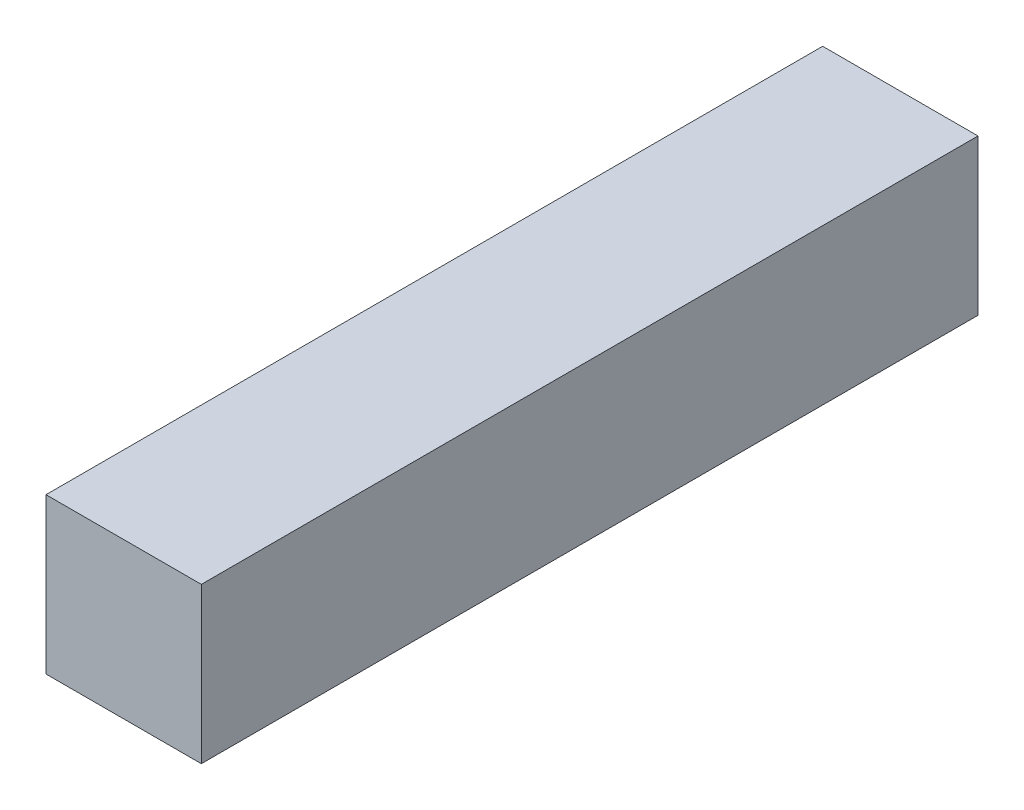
from build123d import *

# Parameters (mm, degrees)
SKETCH1_W      = 20
SKETCH1_H      = 20
EXTRUDE1_DEPTH = 50


with BuildPart() as part:
    # Sketch1 → Extrude1 (new, symmetric)
    with BuildSketch(Plane.XY):
        Rectangle(SKETCH1_W, SKETCH1_H)
    extrude(amount=EXTRUDE1_DEPTH, both=True)


solid = part.part
